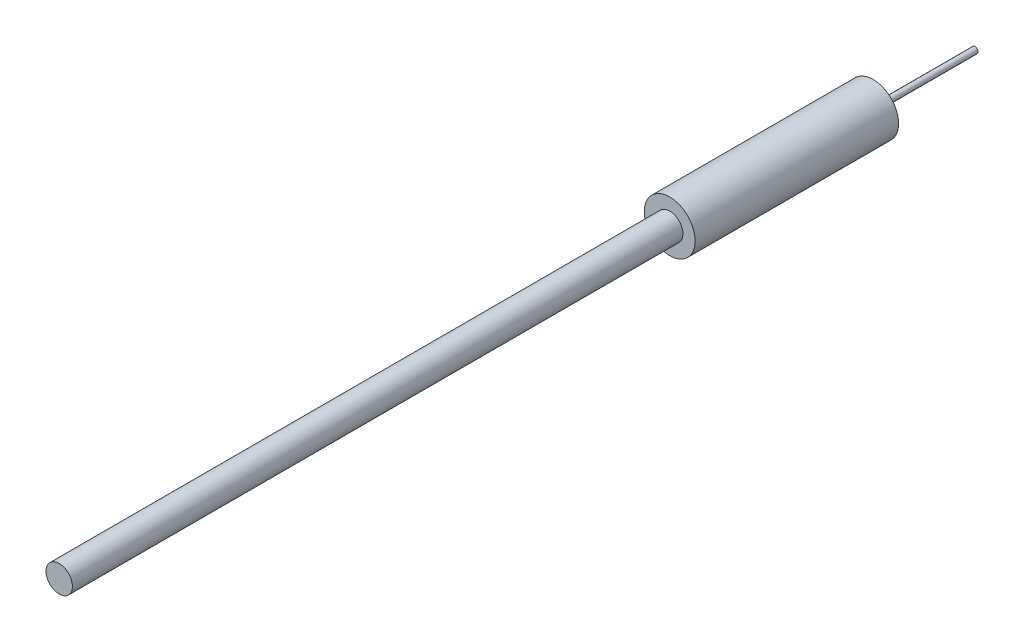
from build123d import *

# Parameters (mm, degrees)
SKETCH_1_R          = 1.25
EXTRUDE_1_DEPTH     = 10
SKETCH_2_R          = 0.15
EXTRUDE_2_DEPTH     = 5
SKETCH_3_R          = 0.65
EXTRUDE_3_DEPTH     = 30
SKETCH_4_R          = 0.0675
SKETCH_4_R_2        = 0.0625
CUT_EXTRUDE_1_DEPTH = 0.1


with BuildPart() as part:
    # Sketch 1 → Extrude 1 (new body)
    with BuildSketch(Plane.XY):
        Circle(SKETCH_1_R)
    extrude(amount=EXTRUDE_1_DEPTH)

    # Sketch 2 → Extrude 2 (add)
    with BuildSketch(Plane(origin=(0, 0, 0), x_dir=(-1, 0, 0), z_dir=(0, 0, -1))):
        with Locations(Location((0, 0, 0), (0, 0, 180))):
            Circle(SKETCH_2_R)
    extrude(amount=EXTRUDE_2_DEPTH)

    # Sketch 3 → Extrude 3 (add)
    with BuildSketch(Plane.XY.offset(10)):
        Circle(SKETCH_3_R)
    extrude(amount=EXTRUDE_3_DEPTH)

    # Sketch 4 → Cut-Extrude 1 (cut)
    with BuildSketch(Plane(origin=(0, 0, -5), x_dir=(-1, 0, 0), z_dir=(0, 0, -1))):
        Circle(SKETCH_4_R)
        Circle(SKETCH_4_R_2, mode=Mode.SUBTRACT)
    extrude(amount=-CUT_EXTRUDE_1_DEPTH, mode=Mode.SUBTRACT)


solid = part.part
